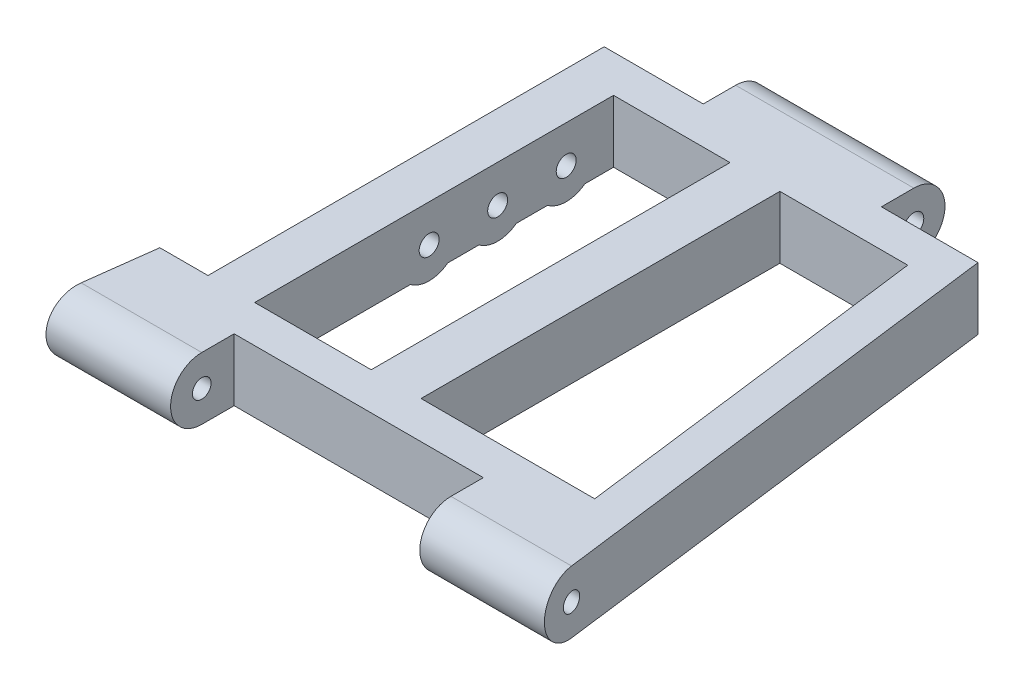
from build123d import *

# Parameters (mm, degrees)
SKETCH_1_W               = 18.7
SKETCH_1_H               = 57.6
EXTRUDE_1_DEPTH          = 10
SKETCH_2_R               = 1.6
CUT_EXTRUDE_1_DEPTH      = 28.6
CUT_EXTRUDE_2_DEPTH      = 123.489842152
CUT_EXTRUDE_2_DEPTH_BACK = 123.489842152
SKETCH_3_R               = 1.5
SKETCH_4_R               = 1.6
CUT_EXTRUDE_3_DEPTH      = 7.5
EXTRUDE_2_DEPTH          = 7.5


with BuildPart() as part:
    # Sketch 1 → Extrude 1 (new body)
    with BuildSketch(Plane(origin=(0, 0, 0), x_dir=(1, 0, 0), z_dir=(0, 1, 0))):
        Polygon((-129.73752184, 96.119148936), (-129.73752184, 32.519148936), (-137.46752184, 32.519148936), (-139.53752184, 16.319148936), (-119.53752184, 16.319148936), (-119.53752184, 26.519148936), (-79.53752184, 26.519148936), (-79.53752184, 16.319148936), (-59.53752184, 16.319148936), (-69.734188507, 96.119148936), (-85.23752184, 96.119148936), (-85.23752184, 106.319148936), (-113.83752184, 106.319148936), (-113.83752184, 96.119148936), align=None)
        Polygon((-75.016305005, 90.119148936), (-67.656305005, 32.519148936), (-95.53752184, 32.519148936), (-95.53752184, 90.119148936), align=None, mode=Mode.SUBTRACT)
        with Locations((-112.88752184, 61.319148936)):
            Rectangle(SKETCH_1_W, SKETCH_1_H, mode=Mode.SUBTRACT)
    extrude(amount=EXTRUDE_1_DEPTH)

    # Sketch 2 → Cut-Extrude 1 (cut)
    with BuildSketch(Plane.ZY.offset(113.83752184)):
        with Locations((-101.319148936, 5)):
            Circle(SKETCH_2_R)
        with BuildLine():
            Line((-106.319148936, 10), (-106.319148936, 5))
            ThreePointArc((-106.319148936, 5), (-104.854682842, 8.535533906), (-101.319148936, 10))
            Line((-101.319148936, 10), (-106.319148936, 10))
        make_face()
        with BuildLine():
            Line((-106.319148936, 5), (-106.319148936, 0))
            Line((-106.319148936, 0), (-101.319148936, 0))
            ThreePointArc((-101.319148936, 0), (-104.854682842, 1.464466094), (-106.319148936, 5))
        make_face()
    extrude(amount=-CUT_EXTRUDE_1_DEPTH, mode=Mode.SUBTRACT)

    # Sketch 3 → Cut-Extrude 2 (cut, two sides: drawn at the far end of the back side and taken through both)
    with BuildSketch(Plane.ZY.offset(79.53752184).offset(-CUT_EXTRUDE_2_DEPTH_BACK)):
        with Locations(Location((-21.319148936, 5, 0), (0, 0, 180))):
            Circle(SKETCH_3_R)
        with BuildLine():
            Line((-16.319148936, 10), (-21.319148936, 10))
            ThreePointArc((-21.319148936, 10), (-17.78361503, 8.535533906), (-16.319148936, 5))
            Line((-16.319148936, 5), (-16.319148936, 10))
        make_face()
        with BuildLine():
            ThreePointArc((-16.319148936, 5), (-17.78361503, 1.464466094), (-21.319148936, 0))
            Line((-21.319148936, 0), (-16.319148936, 0))
            Line((-16.319148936, 0), (-16.319148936, 5))
        make_face()
    extrude(amount=CUT_EXTRUDE_2_DEPTH + CUT_EXTRUDE_2_DEPTH_BACK, mode=Mode.SUBTRACT)

    # Sketch 4 → Cut-Extrude 3 (cut)
    with BuildSketch(Plane.ZY.offset(129.73752184)):
        with Locations((-60.519148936, 4)):
            Circle(SKETCH_4_R)
        with Locations((-71.519148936, 4)):
            Circle(SKETCH_4_R)
        with Locations((-82.519148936, 4)):
            Circle(SKETCH_4_R)
    extrude(amount=-CUT_EXTRUDE_3_DEPTH, mode=Mode.SUBTRACT)

    # Sketch 4_3 → Extrude 2 (add)
    with BuildSketch(Plane.ZY.offset(129.73752184)):
        with BuildLine():
            ThreePointArc((-63.519148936, 0), (-60.519148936, -1), (-57.519148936, 0))
            Line((-57.519148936, 0), (-63.519148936, 0))
        make_face()
        with BuildLine():
            Line((-68.519148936, 0), (-74.519148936, 0))
            ThreePointArc((-74.519148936, 0), (-71.519148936, -1), (-68.519148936, 0))
        make_face()
        with BuildLine():
            Line((-79.519148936, 0), (-85.519148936, 0))
            ThreePointArc((-85.519148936, 0), (-82.519148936, -1), (-79.519148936, 0))
        make_face()
    extrude(amount=-EXTRUDE_2_DEPTH)


solid = part.part
